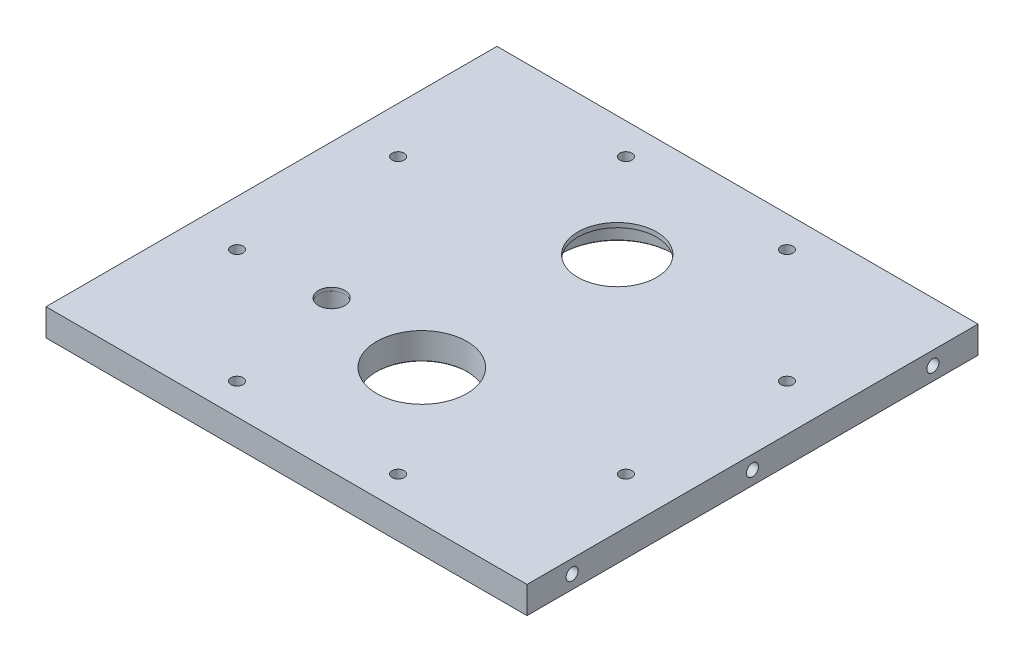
ISO-10303-21;
HEADER;
FILE_DESCRIPTION(('STEP AP214'),'2;1');
FILE_NAME('part.step','',(''),(''),'','','');
FILE_SCHEMA(('AUTOMOTIVE_DESIGN { 1 0 10303 214 1 1 1 1 }'));
ENDSEC;
DATA;
#1=APPLICATION_CONTEXT('core data for automotive mechanical design processes');
#2=APPLICATION_PROTOCOL_DEFINITION('international standard','automotive_design',2000,#1);
#3=PRODUCT_CONTEXT('',#1,'mechanical');
#4=PRODUCT('Part','Part','',(#3));
#5=PRODUCT_RELATED_PRODUCT_CATEGORY('part','',(#4));
#6=PRODUCT_DEFINITION_FORMATION('','',#4);
#7=PRODUCT_DEFINITION_CONTEXT('part definition',#1,'design');
#8=PRODUCT_DEFINITION('design','',#6,#7);
#9=PRODUCT_DEFINITION_SHAPE('','',#8);
#10=(LENGTH_UNIT() NAMED_UNIT(*) SI_UNIT(.MILLI.,.METRE.));
#11=(NAMED_UNIT(*) PLANE_ANGLE_UNIT() SI_UNIT($,.RADIAN.));
#12=(NAMED_UNIT(*) SI_UNIT($,.STERADIAN.) SOLID_ANGLE_UNIT());
#13=UNCERTAINTY_MEASURE_WITH_UNIT(LENGTH_MEASURE(1.E-05),#10,'distance_accuracy_value','');
#14=(GEOMETRIC_REPRESENTATION_CONTEXT(3) GLOBAL_UNCERTAINTY_ASSIGNED_CONTEXT((#13)) GLOBAL_UNIT_ASSIGNED_CONTEXT((#10,
#11,#12)) REPRESENTATION_CONTEXT('',''));
#15=CARTESIAN_POINT('',(0.,0.,0.));
#16=DIRECTION('',(0.,0.,1.));
#17=DIRECTION('',(1.,0.,0.));
#18=AXIS2_PLACEMENT_3D('',#15,#16,#17);
#19=CARTESIAN_POINT('',(0.,11.43,-44.45));
#20=DIRECTION('',(0.,-1.,0.));
#21=DIRECTION('',(0.,0.,-1.));
#22=AXIS2_PLACEMENT_3D('',#19,#20,#21);
#23=CYLINDRICAL_SURFACE('',#22,16.637);
#24=CARTESIAN_POINT('',(0.,11.43,-44.45));
#25=DIRECTION('',(0.,-1.,0.));
#26=DIRECTION('',(0.,0.,-1.));
#27=AXIS2_PLACEMENT_3D('',#24,#25,#26);
#28=CIRCLE('',#27,16.637);
#29=CARTESIAN_POINT('',(0.,11.43,-61.087));
#30=VERTEX_POINT('',#29);
#31=EDGE_CURVE('E320',#30,#30,#28,.T.);
#32=ORIENTED_EDGE('',*,*,#31,.F.);
#33=EDGE_LOOP('',(#32));
#34=FACE_BOUND('',#33,.T.);
#35=CARTESIAN_POINT('',(0.,9.525,-44.45));
#36=DIRECTION('',(0.,-1.,0.));
#37=DIRECTION('',(0.,0.,-1.));
#38=AXIS2_PLACEMENT_3D('',#35,#36,#37);
#39=CIRCLE('',#38,16.637);
#40=CARTESIAN_POINT('',(0.,9.525,-61.087));
#41=VERTEX_POINT('',#40);
#42=EDGE_CURVE('E319',#41,#41,#39,.F.);
#43=ORIENTED_EDGE('',*,*,#42,.F.);
#44=EDGE_LOOP('',(#43));
#45=FACE_BOUND('',#44,.T.);
#46=ADVANCED_FACE('F111',(#34,#45),#23,.F.);
#47=CARTESIAN_POINT('',(0.,11.43,0.));
#48=DIRECTION('',(0.,-1.,0.));
#49=DIRECTION('',(0.,0.,-1.));
#50=AXIS2_PLACEMENT_3D('',#47,#48,#49);
#51=PLANE('',#50);
#52=CARTESIAN_POINT('',(-44.45,11.43,31.75));
#53=DIRECTION('',(0.,-1.,0.));
#54=DIRECTION('',(0.,0.,-1.));
#55=AXIS2_PLACEMENT_3D('',#52,#53,#54);
#56=CIRCLE('',#55,5.5626);
#57=CARTESIAN_POINT('',(-44.45,11.43,26.1874));
#58=VERTEX_POINT('',#57);
#59=EDGE_CURVE('E311',#58,#58,#56,.T.);
#60=ORIENTED_EDGE('',*,*,#59,.T.);
#61=EDGE_LOOP('',(#60));
#62=FACE_BOUND('',#61,.T.);
#63=ORIENTED_EDGE('',*,*,#31,.T.);
#64=EDGE_LOOP('',(#63));
#65=FACE_BOUND('',#64,.T.);
#66=CARTESIAN_POINT('',(0.,11.43,38.1));
#67=DIRECTION('',(0.,-1.,0.));
#68=DIRECTION('',(0.,0.,-1.));
#69=AXIS2_PLACEMENT_3D('',#66,#67,#68);
#70=CIRCLE('',#69,19.0754);
#71=CARTESIAN_POINT('',(0.,11.43,19.0246));
#72=VERTEX_POINT('',#71);
#73=EDGE_CURVE('E324',#72,#72,#70,.T.);
#74=ORIENTED_EDGE('',*,*,#73,.T.);
#75=EDGE_LOOP('',(#74));
#76=FACE_BOUND('',#75,.T.);
#77=CARTESIAN_POINT('',(-82.132890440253,11.43,-34.0205571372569));
#78=DIRECTION('',(0.,1.,0.));
#79=DIRECTION('',(0.,0.,1.));
#80=AXIS2_PLACEMENT_3D('',#77,#78,#79);
#81=CIRCLE('',#80,2.55270000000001);
#82=CARTESIAN_POINT('',(-82.132890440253,11.43,-31.4678571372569));
#83=VERTEX_POINT('',#82);
#84=EDGE_CURVE('E328',#83,#83,#81,.T.);
#85=ORIENTED_EDGE('',*,*,#84,.F.);
#86=EDGE_LOOP('',(#85));
#87=FACE_BOUND('',#86,.T.);
#88=CARTESIAN_POINT('',(-34.0205571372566,11.43,82.1328904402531));
#89=DIRECTION('',(0.,1.,0.));
#90=DIRECTION('',(0.,0.,1.));
#91=AXIS2_PLACEMENT_3D('',#88,#89,#90);
#92=CIRCLE('',#91,2.5527);
#93=CARTESIAN_POINT('',(-34.0205571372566,11.43,84.6855904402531));
#94=VERTEX_POINT('',#93);
#95=EDGE_CURVE('E344',#94,#94,#92,.T.);
#96=ORIENTED_EDGE('',*,*,#95,.F.);
#97=EDGE_LOOP('',(#96));
#98=FACE_BOUND('',#97,.T.);
#99=CARTESIAN_POINT('',(34.0205571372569,11.43,82.132890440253));
#100=DIRECTION('',(0.,1.,0.));
#101=DIRECTION('',(0.,0.,1.));
#102=AXIS2_PLACEMENT_3D('',#99,#100,#101);
#103=CIRCLE('',#102,2.5527);
#104=CARTESIAN_POINT('',(34.0205571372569,11.43,84.685590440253));
#105=VERTEX_POINT('',#104);
#106=EDGE_CURVE('E352',#105,#105,#103,.T.);
#107=ORIENTED_EDGE('',*,*,#106,.F.);
#108=EDGE_LOOP('',(#107));
#109=FACE_BOUND('',#108,.T.);
#110=CARTESIAN_POINT('',(82.1328904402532,11.43,34.0205571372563));
#111=DIRECTION('',(0.,1.,0.));
#112=DIRECTION('',(0.,0.,1.));
#113=AXIS2_PLACEMENT_3D('',#110,#111,#112);
#114=CIRCLE('',#113,2.55270000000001);
#115=CARTESIAN_POINT('',(82.1328904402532,11.43,36.5732571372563));
#116=VERTEX_POINT('',#115);
#117=EDGE_CURVE('E360',#116,#116,#114,.T.);
#118=ORIENTED_EDGE('',*,*,#117,.F.);
#119=EDGE_LOOP('',(#118));
#120=FACE_BOUND('',#119,.T.);
#121=CARTESIAN_POINT('',(82.1328904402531,11.43,-34.0205571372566));
#122=DIRECTION('',(0.,1.,0.));
#123=DIRECTION('',(0.,0.,1.));
#124=AXIS2_PLACEMENT_3D('',#121,#122,#123);
#125=CIRCLE('',#124,2.55270000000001);
#126=CARTESIAN_POINT('',(82.1328904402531,11.43,-31.4678571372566));
#127=VERTEX_POINT('',#126);
#128=EDGE_CURVE('E368',#127,#127,#125,.T.);
#129=ORIENTED_EDGE('',*,*,#128,.F.);
#130=EDGE_LOOP('',(#129));
#131=FACE_BOUND('',#130,.T.);
#132=CARTESIAN_POINT('',(34.020557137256,11.43,-82.1328904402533));
#133=DIRECTION('',(0.,1.,0.));
#134=DIRECTION('',(0.,0.,1.));
#135=AXIS2_PLACEMENT_3D('',#132,#133,#134);
#136=CIRCLE('',#135,2.5527);
#137=CARTESIAN_POINT('',(34.020557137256,11.43,-79.5801904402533));
#138=VERTEX_POINT('',#137);
#139=EDGE_CURVE('E376',#138,#138,#136,.T.);
#140=ORIENTED_EDGE('',*,*,#139,.F.);
#141=EDGE_LOOP('',(#140));
#142=FACE_BOUND('',#141,.T.);
#143=CARTESIAN_POINT('',(-34.0205571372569,11.43,-82.132890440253));
#144=DIRECTION('',(0.,1.,0.));
#145=DIRECTION('',(0.,0.,1.));
#146=AXIS2_PLACEMENT_3D('',#143,#144,#145);
#147=CIRCLE('',#146,2.5527);
#148=CARTESIAN_POINT('',(-34.0205571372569,11.43,-79.5801904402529));
#149=VERTEX_POINT('',#148);
#150=EDGE_CURVE('E384',#149,#149,#147,.T.);
#151=ORIENTED_EDGE('',*,*,#150,.F.);
#152=EDGE_LOOP('',(#151));
#153=FACE_BOUND('',#152,.T.);
#154=DIRECTION('',(0.,0.,-1.));
#155=VECTOR('',#154,1.);
#156=CARTESIAN_POINT('',(101.6,11.43,95.25));
#157=LINE('',#156,#155);
#158=CARTESIAN_POINT('',(101.6,11.43,95.25));
#159=VERTEX_POINT('',#158);
#160=CARTESIAN_POINT('',(101.6,11.43,-95.25));
#161=VERTEX_POINT('',#160);
#162=EDGE_CURVE('E393',#159,#161,#157,.T.);
#163=ORIENTED_EDGE('',*,*,#162,.T.);
#164=DIRECTION('',(-1.,0.,0.));
#165=VECTOR('',#164,1.);
#166=CARTESIAN_POINT('',(-101.6,11.43,-95.25));
#167=LINE('',#166,#165);
#168=CARTESIAN_POINT('',(-101.6,11.43,-95.25));
#169=VERTEX_POINT('',#168);
#170=EDGE_CURVE('E162',#161,#169,#167,.T.);
#171=ORIENTED_EDGE('',*,*,#170,.T.);
#172=DIRECTION('',(0.,0.,1.));
#173=VECTOR('',#172,1.);
#174=CARTESIAN_POINT('',(-101.6,11.43,95.25));
#175=LINE('',#174,#173);
#176=CARTESIAN_POINT('',(-101.6,11.43,95.25));
#177=VERTEX_POINT('',#176);
#178=EDGE_CURVE('E398',#169,#177,#175,.T.);
#179=ORIENTED_EDGE('',*,*,#178,.T.);
#180=DIRECTION('',(1.,0.,0.));
#181=VECTOR('',#180,1.);
#182=CARTESIAN_POINT('',(-101.6,11.43,95.25));
#183=LINE('',#182,#181);
#184=EDGE_CURVE('E130',#177,#159,#183,.T.);
#185=ORIENTED_EDGE('',*,*,#184,.T.);
#186=EDGE_LOOP('',(#163,#171,#179,#185));
#187=FACE_BOUND('',#186,.T.);
#188=CARTESIAN_POINT('',(-82.1328904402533,11.43,34.020557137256));
#189=DIRECTION('',(0.,1.,0.));
#190=DIRECTION('',(0.,0.,1.));
#191=AXIS2_PLACEMENT_3D('',#188,#189,#190);
#192=CIRCLE('',#191,2.55270000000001);
#193=CARTESIAN_POINT('',(-82.1328904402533,11.43,36.573257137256));
#194=VERTEX_POINT('',#193);
#195=EDGE_CURVE('E336',#194,#194,#192,.T.);
#196=ORIENTED_EDGE('',*,*,#195,.F.);
#197=EDGE_LOOP('',(#196));
#198=FACE_BOUND('',#197,.T.);
#199=ADVANCED_FACE('F463',(#62,#65,#76,#87,#98,#109,#120,#131,#142,#153,#187,#198),#51,.F.);
#200=CARTESIAN_POINT('',(101.6,11.43,95.25));
#201=DIRECTION('',(-1.,0.,0.));
#202=DIRECTION('',(0.,0.,1.));
#203=AXIS2_PLACEMENT_3D('',#200,#201,#202);
#204=PLANE('',#203);
#205=CARTESIAN_POINT('',(101.6,5.715,-76.2));
#206=DIRECTION('',(1.,0.,0.));
#207=DIRECTION('',(0.,0.,-1.));
#208=AXIS2_PLACEMENT_3D('',#205,#206,#207);
#209=CIRCLE('',#208,2.55269999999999);
#210=CARTESIAN_POINT('',(101.6,5.715,-78.7527));
#211=VERTEX_POINT('',#210);
#212=EDGE_CURVE('E205',#211,#211,#209,.T.);
#213=ORIENTED_EDGE('',*,*,#212,.F.);
#214=EDGE_LOOP('',(#213));
#215=FACE_BOUND('',#214,.T.);
#216=CARTESIAN_POINT('',(101.6,5.715,76.2));
#217=DIRECTION('',(1.,0.,0.));
#218=DIRECTION('',(0.,0.,-1.));
#219=AXIS2_PLACEMENT_3D('',#216,#217,#218);
#220=CIRCLE('',#219,2.55269999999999);
#221=CARTESIAN_POINT('',(101.6,5.715,73.6473));
#222=VERTEX_POINT('',#221);
#223=EDGE_CURVE('E204',#222,#222,#220,.T.);
#224=ORIENTED_EDGE('',*,*,#223,.F.);
#225=EDGE_LOOP('',(#224));
#226=FACE_BOUND('',#225,.T.);
#227=CARTESIAN_POINT('',(101.6,5.715,0.));
#228=DIRECTION('',(1.,0.,0.));
#229=DIRECTION('',(0.,0.,-1.));
#230=AXIS2_PLACEMENT_3D('',#227,#228,#229);
#231=CIRCLE('',#230,2.55269999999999);
#232=CARTESIAN_POINT('',(101.6,5.715,-2.55269999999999));
#233=VERTEX_POINT('',#232);
#234=EDGE_CURVE('E219',#233,#233,#231,.T.);
#235=ORIENTED_EDGE('',*,*,#234,.F.);
#236=EDGE_LOOP('',(#235));
#237=FACE_BOUND('',#236,.T.);
#238=DIRECTION('',(0.,0.,-1.));
#239=VECTOR('',#238,1.);
#240=CARTESIAN_POINT('',(101.6,0.,95.25));
#241=LINE('',#240,#239);
#242=CARTESIAN_POINT('',(101.6,0.,95.25));
#243=VERTEX_POINT('',#242);
#244=CARTESIAN_POINT('',(101.6,0.,-95.25));
#245=VERTEX_POINT('',#244);
#246=EDGE_CURVE('E392',#243,#245,#241,.T.);
#247=ORIENTED_EDGE('',*,*,#246,.T.);
#248=DIRECTION('',(0.,-1.,0.));
#249=VECTOR('',#248,1.);
#250=CARTESIAN_POINT('',(101.6,11.43,-95.25));
#251=LINE('',#250,#249);
#252=EDGE_CURVE('E422',#161,#245,#251,.T.);
#253=ORIENTED_EDGE('',*,*,#252,.F.);
#254=ORIENTED_EDGE('',*,*,#162,.F.);
#255=DIRECTION('',(0.,-1.,0.));
#256=VECTOR('',#255,1.);
#257=CARTESIAN_POINT('',(101.6,11.43,95.25));
#258=LINE('',#257,#256);
#259=EDGE_CURVE('E403',#159,#243,#258,.T.);
#260=ORIENTED_EDGE('',*,*,#259,.T.);
#261=EDGE_LOOP('',(#247,#253,#254,#260));
#262=FACE_BOUND('',#261,.T.);
#263=ADVANCED_FACE('F470',(#215,#226,#237,#262),#204,.F.);
#264=CARTESIAN_POINT('',(-101.6,11.43,-95.25));
#265=DIRECTION('',(0.,0.,1.));
#266=DIRECTION('',(1.,0.,0.));
#267=AXIS2_PLACEMENT_3D('',#264,#265,#266);
#268=PLANE('',#267);
#269=DIRECTION('',(-1.,0.,0.));
#270=VECTOR('',#269,1.);
#271=CARTESIAN_POINT('',(-101.6,0.,-95.25));
#272=LINE('',#271,#270);
#273=CARTESIAN_POINT('',(-101.6,0.,-95.25));
#274=VERTEX_POINT('',#273);
#275=EDGE_CURVE('E407',#245,#274,#272,.T.);
#276=ORIENTED_EDGE('',*,*,#275,.T.);
#277=DIRECTION('',(0.,-1.,0.));
#278=VECTOR('',#277,1.);
#279=CARTESIAN_POINT('',(-101.6,11.43,-95.25));
#280=LINE('',#279,#278);
#281=EDGE_CURVE('E419',#169,#274,#280,.T.);
#282=ORIENTED_EDGE('',*,*,#281,.F.);
#283=ORIENTED_EDGE('',*,*,#170,.F.);
#284=ORIENTED_EDGE('',*,*,#252,.T.);
#285=EDGE_LOOP('',(#276,#282,#283,#284));
#286=FACE_BOUND('',#285,.T.);
#287=ADVANCED_FACE('F518',(#286),#268,.F.);
#288=CARTESIAN_POINT('',(-101.6,11.43,95.25));
#289=DIRECTION('',(1.,0.,0.));
#290=DIRECTION('',(0.,0.,-1.));
#291=AXIS2_PLACEMENT_3D('',#288,#289,#290);
#292=PLANE('',#291);
#293=CARTESIAN_POINT('',(-101.6,5.715,-76.2));
#294=DIRECTION('',(-1.,0.,0.));
#295=DIRECTION('',(0.,0.,1.));
#296=AXIS2_PLACEMENT_3D('',#293,#294,#295);
#297=CIRCLE('',#296,2.55269999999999);
#298=CARTESIAN_POINT('',(-101.6,5.715,-73.6473));
#299=VERTEX_POINT('',#298);
#300=EDGE_CURVE('E227',#299,#299,#297,.T.);
#301=ORIENTED_EDGE('',*,*,#300,.F.);
#302=EDGE_LOOP('',(#301));
#303=FACE_BOUND('',#302,.T.);
#304=CARTESIAN_POINT('',(-101.6,5.715,76.2));
#305=DIRECTION('',(-1.,0.,0.));
#306=DIRECTION('',(0.,0.,1.));
#307=AXIS2_PLACEMENT_3D('',#304,#305,#306);
#308=CIRCLE('',#307,2.55269999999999);
#309=CARTESIAN_POINT('',(-101.6,5.715,78.7527));
#310=VERTEX_POINT('',#309);
#311=EDGE_CURVE('E235',#310,#310,#308,.T.);
#312=ORIENTED_EDGE('',*,*,#311,.F.);
#313=EDGE_LOOP('',(#312));
#314=FACE_BOUND('',#313,.T.);
#315=CARTESIAN_POINT('',(-101.6,5.715,0.));
#316=DIRECTION('',(-1.,0.,0.));
#317=DIRECTION('',(0.,0.,1.));
#318=AXIS2_PLACEMENT_3D('',#315,#316,#317);
#319=CIRCLE('',#318,2.55269999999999);
#320=CARTESIAN_POINT('',(-101.6,5.715,2.55269999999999));
#321=VERTEX_POINT('',#320);
#322=EDGE_CURVE('E243',#321,#321,#319,.T.);
#323=ORIENTED_EDGE('',*,*,#322,.F.);
#324=EDGE_LOOP('',(#323));
#325=FACE_BOUND('',#324,.T.);
#326=DIRECTION('',(0.,0.,1.));
#327=VECTOR('',#326,1.);
#328=CARTESIAN_POINT('',(-101.6,0.,95.25));
#329=LINE('',#328,#327);
#330=CARTESIAN_POINT('',(-101.6,0.,95.25));
#331=VERTEX_POINT('',#330);
#332=EDGE_CURVE('E148',#274,#331,#329,.T.);
#333=ORIENTED_EDGE('',*,*,#332,.T.);
#334=DIRECTION('',(0.,-1.,0.));
#335=VECTOR('',#334,1.);
#336=CARTESIAN_POINT('',(-101.6,11.43,95.25));
#337=LINE('',#336,#335);
#338=EDGE_CURVE('E416',#177,#331,#337,.T.);
#339=ORIENTED_EDGE('',*,*,#338,.F.);
#340=ORIENTED_EDGE('',*,*,#178,.F.);
#341=ORIENTED_EDGE('',*,*,#281,.T.);
#342=EDGE_LOOP('',(#333,#339,#340,#341));
#343=FACE_BOUND('',#342,.T.);
#344=ADVANCED_FACE('F515',(#303,#314,#325,#343),#292,.F.);
#345=CARTESIAN_POINT('',(-101.6,11.43,95.25));
#346=DIRECTION('',(0.,0.,-1.));
#347=DIRECTION('',(-1.,0.,0.));
#348=AXIS2_PLACEMENT_3D('',#345,#346,#347);
#349=PLANE('',#348);
#350=DIRECTION('',(1.,0.,0.));
#351=VECTOR('',#350,1.);
#352=CARTESIAN_POINT('',(-101.6,0.,95.25));
#353=LINE('',#352,#351);
#354=EDGE_CURVE('E154',#331,#243,#353,.T.);
#355=ORIENTED_EDGE('',*,*,#354,.T.);
#356=ORIENTED_EDGE('',*,*,#259,.F.);
#357=ORIENTED_EDGE('',*,*,#184,.F.);
#358=ORIENTED_EDGE('',*,*,#338,.T.);
#359=EDGE_LOOP('',(#355,#356,#357,#358));
#360=FACE_BOUND('',#359,.T.);
#361=ADVANCED_FACE('F512',(#360),#349,.F.);
#362=CARTESIAN_POINT('',(0.,0.,0.));
#363=DIRECTION('',(0.,-1.,0.));
#364=DIRECTION('',(0.,0.,-1.));
#365=AXIS2_PLACEMENT_3D('',#362,#363,#364);
#366=PLANE('',#365);
#367=CARTESIAN_POINT('',(0.,0.,-44.45));
#368=DIRECTION('',(0.,-1.,0.));
#369=DIRECTION('',(0.,0.,-1.));
#370=AXIS2_PLACEMENT_3D('',#367,#368,#369);
#371=CIRCLE('',#370,23.56866);
#372=CARTESIAN_POINT('',(0.,0.,-68.01866));
#373=VERTEX_POINT('',#372);
#374=EDGE_CURVE('E122',#373,#373,#371,.F.);
#375=ORIENTED_EDGE('',*,*,#374,.T.);
#376=EDGE_LOOP('',(#375));
#377=FACE_BOUND('',#376,.T.);
#378=CARTESIAN_POINT('',(0.,0.,38.1));
#379=DIRECTION('',(0.,-1.,0.));
#380=DIRECTION('',(0.,0.,-1.));
#381=AXIS2_PLACEMENT_3D('',#378,#379,#380);
#382=CIRCLE('',#381,19.4665599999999);
#383=CARTESIAN_POINT('',(0.,0.,18.6334400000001));
#384=VERTEX_POINT('',#383);
#385=EDGE_CURVE('E432',#384,#384,#382,.F.);
#386=ORIENTED_EDGE('',*,*,#385,.T.);
#387=EDGE_LOOP('',(#386));
#388=FACE_BOUND('',#387,.T.);
#389=CARTESIAN_POINT('',(-22.225,0.,38.1000000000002));
#390=DIRECTION('',(0.,-1.,0.));
#391=DIRECTION('',(0.,0.,-1.));
#392=AXIS2_PLACEMENT_3D('',#389,#390,#391);
#393=CIRCLE('',#392,1.9939);
#394=CARTESIAN_POINT('',(-22.225,0.,36.1061000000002));
#395=VERTEX_POINT('',#394);
#396=EDGE_CURVE('E251',#395,#395,#393,.T.);
#397=ORIENTED_EDGE('',*,*,#396,.F.);
#398=EDGE_LOOP('',(#397));
#399=FACE_BOUND('',#398,.T.);
#400=CARTESIAN_POINT('',(0.,0.,15.875));
#401=DIRECTION('',(0.,-1.,0.));
#402=DIRECTION('',(0.,0.,-1.));
#403=AXIS2_PLACEMENT_3D('',#400,#401,#402);
#404=CIRCLE('',#403,1.9939);
#405=CARTESIAN_POINT('',(0.,0.,13.8811));
#406=VERTEX_POINT('',#405);
#407=EDGE_CURVE('E263',#406,#406,#404,.T.);
#408=ORIENTED_EDGE('',*,*,#407,.F.);
#409=EDGE_LOOP('',(#408));
#410=FACE_BOUND('',#409,.T.);
#411=CARTESIAN_POINT('',(22.225,0.,38.0999999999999));
#412=DIRECTION('',(0.,-1.,0.));
#413=DIRECTION('',(0.,0.,-1.));
#414=AXIS2_PLACEMENT_3D('',#411,#412,#413);
#415=CIRCLE('',#414,1.9939);
#416=CARTESIAN_POINT('',(22.225,0.,36.1060999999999));
#417=VERTEX_POINT('',#416);
#418=EDGE_CURVE('E275',#417,#417,#415,.T.);
#419=ORIENTED_EDGE('',*,*,#418,.F.);
#420=EDGE_LOOP('',(#419));
#421=FACE_BOUND('',#420,.T.);
#422=CARTESIAN_POINT('',(0.,0.,60.325));
#423=DIRECTION('',(0.,-1.,0.));
#424=DIRECTION('',(0.,0.,-1.));
#425=AXIS2_PLACEMENT_3D('',#422,#423,#424);
#426=CIRCLE('',#425,1.9939);
#427=CARTESIAN_POINT('',(0.,0.,58.3311));
#428=VERTEX_POINT('',#427);
#429=EDGE_CURVE('E287',#428,#428,#426,.T.);
#430=ORIENTED_EDGE('',*,*,#429,.F.);
#431=EDGE_LOOP('',(#430));
#432=FACE_BOUND('',#431,.T.);
#433=CARTESIAN_POINT('',(-44.45,0.,31.75));
#434=DIRECTION('',(0.,-1.,0.));
#435=DIRECTION('',(0.,0.,-1.));
#436=AXIS2_PLACEMENT_3D('',#433,#434,#435);
#437=CIRCLE('',#436,6.244082);
#438=CARTESIAN_POINT('',(-44.45,0.,25.505918));
#439=VERTEX_POINT('',#438);
#440=EDGE_CURVE('E299',#439,#439,#437,.T.);
#441=ORIENTED_EDGE('',*,*,#440,.F.);
#442=EDGE_LOOP('',(#441));
#443=FACE_BOUND('',#442,.T.);
#444=CARTESIAN_POINT('',(-82.132890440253,0.,-34.0205571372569));
#445=DIRECTION('',(0.,1.,0.));
#446=DIRECTION('',(0.,0.,1.));
#447=AXIS2_PLACEMENT_3D('',#444,#445,#446);
#448=CIRCLE('',#447,2.55269999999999);
#449=CARTESIAN_POINT('',(-82.132890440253,0.,-31.4678571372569));
#450=VERTEX_POINT('',#449);
#451=EDGE_CURVE('E332',#450,#450,#448,.T.);
#452=ORIENTED_EDGE('',*,*,#451,.T.);
#453=EDGE_LOOP('',(#452));
#454=FACE_BOUND('',#453,.T.);
#455=CARTESIAN_POINT('',(-82.1328904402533,0.,34.020557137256));
#456=DIRECTION('',(0.,1.,0.));
#457=DIRECTION('',(0.,0.,1.));
#458=AXIS2_PLACEMENT_3D('',#455,#456,#457);
#459=CIRCLE('',#458,2.55269999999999);
#460=CARTESIAN_POINT('',(-82.1328904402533,0.,36.573257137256));
#461=VERTEX_POINT('',#460);
#462=EDGE_CURVE('E340',#461,#461,#459,.T.);
#463=ORIENTED_EDGE('',*,*,#462,.T.);
#464=EDGE_LOOP('',(#463));
#465=FACE_BOUND('',#464,.T.);
#466=CARTESIAN_POINT('',(-34.0205571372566,0.,82.1328904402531));
#467=DIRECTION('',(0.,1.,0.));
#468=DIRECTION('',(0.,0.,1.));
#469=AXIS2_PLACEMENT_3D('',#466,#467,#468);
#470=CIRCLE('',#469,2.5527);
#471=CARTESIAN_POINT('',(-34.0205571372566,0.,84.6855904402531));
#472=VERTEX_POINT('',#471);
#473=EDGE_CURVE('E348',#472,#472,#470,.T.);
#474=ORIENTED_EDGE('',*,*,#473,.T.);
#475=EDGE_LOOP('',(#474));
#476=FACE_BOUND('',#475,.T.);
#477=CARTESIAN_POINT('',(34.0205571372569,0.,82.132890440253));
#478=DIRECTION('',(0.,1.,0.));
#479=DIRECTION('',(0.,0.,1.));
#480=AXIS2_PLACEMENT_3D('',#477,#478,#479);
#481=CIRCLE('',#480,2.5527);
#482=CARTESIAN_POINT('',(34.0205571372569,0.,84.685590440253));
#483=VERTEX_POINT('',#482);
#484=EDGE_CURVE('E356',#483,#483,#481,.T.);
#485=ORIENTED_EDGE('',*,*,#484,.T.);
#486=EDGE_LOOP('',(#485));
#487=FACE_BOUND('',#486,.T.);
#488=CARTESIAN_POINT('',(82.1328904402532,0.,34.0205571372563));
#489=DIRECTION('',(0.,1.,0.));
#490=DIRECTION('',(0.,0.,1.));
#491=AXIS2_PLACEMENT_3D('',#488,#489,#490);
#492=CIRCLE('',#491,2.55269999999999);
#493=CARTESIAN_POINT('',(82.1328904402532,0.,36.5732571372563));
#494=VERTEX_POINT('',#493);
#495=EDGE_CURVE('E364',#494,#494,#492,.T.);
#496=ORIENTED_EDGE('',*,*,#495,.T.);
#497=EDGE_LOOP('',(#496));
#498=FACE_BOUND('',#497,.T.);
#499=CARTESIAN_POINT('',(82.1328904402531,0.,-34.0205571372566));
#500=DIRECTION('',(0.,1.,0.));
#501=DIRECTION('',(0.,0.,1.));
#502=AXIS2_PLACEMENT_3D('',#499,#500,#501);
#503=CIRCLE('',#502,2.55269999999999);
#504=CARTESIAN_POINT('',(82.1328904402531,0.,-31.4678571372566));
#505=VERTEX_POINT('',#504);
#506=EDGE_CURVE('E372',#505,#505,#503,.T.);
#507=ORIENTED_EDGE('',*,*,#506,.T.);
#508=EDGE_LOOP('',(#507));
#509=FACE_BOUND('',#508,.T.);
#510=CARTESIAN_POINT('',(34.020557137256,0.,-82.1328904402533));
#511=DIRECTION('',(0.,1.,0.));
#512=DIRECTION('',(0.,0.,1.));
#513=AXIS2_PLACEMENT_3D('',#510,#511,#512);
#514=CIRCLE('',#513,2.5527);
#515=CARTESIAN_POINT('',(34.020557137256,0.,-79.5801904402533));
#516=VERTEX_POINT('',#515);
#517=EDGE_CURVE('E380',#516,#516,#514,.T.);
#518=ORIENTED_EDGE('',*,*,#517,.T.);
#519=EDGE_LOOP('',(#518));
#520=FACE_BOUND('',#519,.T.);
#521=CARTESIAN_POINT('',(-34.0205571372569,0.,-82.132890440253));
#522=DIRECTION('',(0.,1.,0.));
#523=DIRECTION('',(0.,0.,1.));
#524=AXIS2_PLACEMENT_3D('',#521,#522,#523);
#525=CIRCLE('',#524,2.5527);
#526=CARTESIAN_POINT('',(-34.0205571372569,0.,-79.5801904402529));
#527=VERTEX_POINT('',#526);
#528=EDGE_CURVE('E388',#527,#527,#525,.T.);
#529=ORIENTED_EDGE('',*,*,#528,.T.);
#530=EDGE_LOOP('',(#529));
#531=FACE_BOUND('',#530,.T.);
#532=ORIENTED_EDGE('',*,*,#246,.F.);
#533=ORIENTED_EDGE('',*,*,#354,.F.);
#534=ORIENTED_EDGE('',*,*,#332,.F.);
#535=ORIENTED_EDGE('',*,*,#275,.F.);
#536=EDGE_LOOP('',(#532,#533,#534,#535));
#537=FACE_BOUND('',#536,.T.);
#538=ADVANCED_FACE('F440',(#377,#388,#399,#410,#421,#432,#443,#454,#465,#476,#487,#498,#509,
#520,#531,#537),#366,.T.);
#539=CARTESIAN_POINT('',(-34.0205571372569,11.43,-82.132890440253));
#540=DIRECTION('',(0.,1.,0.));
#541=DIRECTION('',(0.,0.,1.));
#542=AXIS2_PLACEMENT_3D('',#539,#540,#541);
#543=CYLINDRICAL_SURFACE('',#542,2.5527);
#544=ORIENTED_EDGE('',*,*,#528,.F.);
#545=EDGE_LOOP('',(#544));
#546=FACE_BOUND('',#545,.T.);
#547=ORIENTED_EDGE('',*,*,#150,.T.);
#548=EDGE_LOOP('',(#547));
#549=FACE_BOUND('',#548,.T.);
#550=ADVANCED_FACE('F505',(#546,#549),#543,.F.);
#551=CARTESIAN_POINT('',(34.020557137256,11.43,-82.1328904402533));
#552=DIRECTION('',(0.,1.,0.));
#553=DIRECTION('',(0.,0.,1.));
#554=AXIS2_PLACEMENT_3D('',#551,#552,#553);
#555=CYLINDRICAL_SURFACE('',#554,2.5527);
#556=ORIENTED_EDGE('',*,*,#517,.F.);
#557=EDGE_LOOP('',(#556));
#558=FACE_BOUND('',#557,.T.);
#559=ORIENTED_EDGE('',*,*,#139,.T.);
#560=EDGE_LOOP('',(#559));
#561=FACE_BOUND('',#560,.T.);
#562=ADVANCED_FACE('F501',(#558,#561),#555,.F.);
#563=CARTESIAN_POINT('',(82.1328904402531,11.43,-34.0205571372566));
#564=DIRECTION('',(0.,1.,0.));
#565=DIRECTION('',(0.,0.,1.));
#566=AXIS2_PLACEMENT_3D('',#563,#564,#565);
#567=CYLINDRICAL_SURFACE('',#566,2.5527);
#568=ORIENTED_EDGE('',*,*,#506,.F.);
#569=EDGE_LOOP('',(#568));
#570=FACE_BOUND('',#569,.T.);
#571=ORIENTED_EDGE('',*,*,#128,.T.);
#572=EDGE_LOOP('',(#571));
#573=FACE_BOUND('',#572,.T.);
#574=ADVANCED_FACE('F497',(#570,#573),#567,.F.);
#575=CARTESIAN_POINT('',(82.1328904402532,11.43,34.0205571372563));
#576=DIRECTION('',(0.,1.,0.));
#577=DIRECTION('',(0.,0.,1.));
#578=AXIS2_PLACEMENT_3D('',#575,#576,#577);
#579=CYLINDRICAL_SURFACE('',#578,2.5527);
#580=ORIENTED_EDGE('',*,*,#495,.F.);
#581=EDGE_LOOP('',(#580));
#582=FACE_BOUND('',#581,.T.);
#583=ORIENTED_EDGE('',*,*,#117,.T.);
#584=EDGE_LOOP('',(#583));
#585=FACE_BOUND('',#584,.T.);
#586=ADVANCED_FACE('F493',(#582,#585),#579,.F.);
#587=CARTESIAN_POINT('',(34.0205571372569,11.43,82.132890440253));
#588=DIRECTION('',(0.,1.,0.));
#589=DIRECTION('',(0.,0.,1.));
#590=AXIS2_PLACEMENT_3D('',#587,#588,#589);
#591=CYLINDRICAL_SURFACE('',#590,2.5527);
#592=ORIENTED_EDGE('',*,*,#484,.F.);
#593=EDGE_LOOP('',(#592));
#594=FACE_BOUND('',#593,.T.);
#595=ORIENTED_EDGE('',*,*,#106,.T.);
#596=EDGE_LOOP('',(#595));
#597=FACE_BOUND('',#596,.T.);
#598=ADVANCED_FACE('F489',(#594,#597),#591,.F.);
#599=CARTESIAN_POINT('',(-34.0205571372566,11.43,82.1328904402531));
#600=DIRECTION('',(0.,1.,0.));
#601=DIRECTION('',(0.,0.,1.));
#602=AXIS2_PLACEMENT_3D('',#599,#600,#601);
#603=CYLINDRICAL_SURFACE('',#602,2.5527);
#604=ORIENTED_EDGE('',*,*,#473,.F.);
#605=EDGE_LOOP('',(#604));
#606=FACE_BOUND('',#605,.T.);
#607=ORIENTED_EDGE('',*,*,#95,.T.);
#608=EDGE_LOOP('',(#607));
#609=FACE_BOUND('',#608,.T.);
#610=ADVANCED_FACE('F485',(#606,#609),#603,.F.);
#611=CARTESIAN_POINT('',(-82.1328904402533,11.43,34.020557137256));
#612=DIRECTION('',(0.,1.,0.));
#613=DIRECTION('',(0.,0.,1.));
#614=AXIS2_PLACEMENT_3D('',#611,#612,#613);
#615=CYLINDRICAL_SURFACE('',#614,2.5527);
#616=ORIENTED_EDGE('',*,*,#462,.F.);
#617=EDGE_LOOP('',(#616));
#618=FACE_BOUND('',#617,.T.);
#619=ORIENTED_EDGE('',*,*,#195,.T.);
#620=EDGE_LOOP('',(#619));
#621=FACE_BOUND('',#620,.T.);
#622=ADVANCED_FACE('F481',(#618,#621),#615,.F.);
#623=CARTESIAN_POINT('',(-82.132890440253,11.43,-34.0205571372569));
#624=DIRECTION('',(0.,1.,0.));
#625=DIRECTION('',(0.,0.,1.));
#626=AXIS2_PLACEMENT_3D('',#623,#624,#625);
#627=CYLINDRICAL_SURFACE('',#626,2.5527);
#628=ORIENTED_EDGE('',*,*,#451,.F.);
#629=EDGE_LOOP('',(#628));
#630=FACE_BOUND('',#629,.T.);
#631=ORIENTED_EDGE('',*,*,#84,.T.);
#632=EDGE_LOOP('',(#631));
#633=FACE_BOUND('',#632,.T.);
#634=ADVANCED_FACE('F477',(#630,#633),#627,.F.);
#635=CARTESIAN_POINT('',(0.,11.43,38.1));
#636=DIRECTION('',(0.,-1.,0.));
#637=DIRECTION('',(0.,0.,-1.));
#638=AXIS2_PLACEMENT_3D('',#635,#636,#637);
#639=CYLINDRICAL_SURFACE('',#638,19.0754);
#640=CARTESIAN_POINT('',(0.,0.391159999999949,38.1));
#641=DIRECTION('',(0.,-1.,0.));
#642=DIRECTION('',(0.,0.,-1.));
#643=AXIS2_PLACEMENT_3D('',#640,#641,#642);
#644=CIRCLE('',#643,19.0754);
#645=CARTESIAN_POINT('',(0.,0.391159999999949,19.0246));
#646=VERTEX_POINT('',#645);
#647=EDGE_CURVE('E14',#646,#646,#644,.T.);
#648=ORIENTED_EDGE('',*,*,#647,.T.);
#649=EDGE_LOOP('',(#648));
#650=FACE_BOUND('',#649,.T.);
#651=ORIENTED_EDGE('',*,*,#73,.F.);
#652=EDGE_LOOP('',(#651));
#653=FACE_BOUND('',#652,.T.);
#654=ADVANCED_FACE('F458',(#650,#653),#639,.F.);
#655=CARTESIAN_POINT('',(0.,9.525,-44.45));
#656=DIRECTION('',(0.,-1.,0.));
#657=DIRECTION('',(0.,0.,-1.));
#658=AXIS2_PLACEMENT_3D('',#655,#656,#657);
#659=PLANE('',#658);
#660=CARTESIAN_POINT('',(0.,9.525,-44.45));
#661=DIRECTION('',(0.,-1.,0.));
#662=DIRECTION('',(0.,0.,-1.));
#663=AXIS2_PLACEMENT_3D('',#660,#661,#662);
#664=CIRCLE('',#663,23.1775);
#665=CARTESIAN_POINT('',(0.,9.525,-67.6275));
#666=VERTEX_POINT('',#665);
#667=EDGE_CURVE('E315',#666,#666,#664,.T.);
#668=ORIENTED_EDGE('',*,*,#667,.T.);
#669=EDGE_LOOP('',(#668));
#670=FACE_BOUND('',#669,.T.);
#671=ORIENTED_EDGE('',*,*,#42,.T.);
#672=EDGE_LOOP('',(#671));
#673=FACE_BOUND('',#672,.T.);
#674=ADVANCED_FACE('F452',(#670,#673),#659,.T.);
#675=CARTESIAN_POINT('',(0.,9.525,-44.45));
#676=DIRECTION('',(0.,-1.,0.));
#677=DIRECTION('',(0.,0.,-1.));
#678=AXIS2_PLACEMENT_3D('',#675,#676,#677);
#679=CYLINDRICAL_SURFACE('',#678,23.1775);
#680=CARTESIAN_POINT('',(0.,0.391160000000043,-44.45));
#681=DIRECTION('',(0.,-1.,0.));
#682=DIRECTION('',(0.,0.,-1.));
#683=AXIS2_PLACEMENT_3D('',#680,#681,#682);
#684=CIRCLE('',#683,23.1775);
#685=CARTESIAN_POINT('',(0.,0.391160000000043,-67.6275));
#686=VERTEX_POINT('',#685);
#687=EDGE_CURVE('E425',#686,#686,#684,.T.);
#688=CARTESIAN_POINT('',(0.,0.391160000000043,-67.6275));
#689=CARTESIAN_POINT('',(0.,0.486304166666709,-67.6275));
#690=CARTESIAN_POINT('',(0.,0.581448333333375,-67.6275));
#691=CARTESIAN_POINT('',(0.,0.771736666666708,-67.6275));
#692=CARTESIAN_POINT('',(0.,0.866880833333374,-67.6275));
#693=CARTESIAN_POINT('',(0.,1.05716916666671,-67.6275));
#694=CARTESIAN_POINT('',(0.,1.15231333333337,-67.6275));
#695=CARTESIAN_POINT('',(0.,1.34260166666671,-67.6275));
#696=CARTESIAN_POINT('',(0.,1.43774583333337,-67.6275));
#697=CARTESIAN_POINT('',(0.,1.6280341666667,-67.6275));
#698=CARTESIAN_POINT('',(0.,1.72317833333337,-67.6275));
#699=CARTESIAN_POINT('',(0.,1.9134666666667,-67.6275));
#700=CARTESIAN_POINT('',(0.,2.00861083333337,-67.6275));
#701=CARTESIAN_POINT('',(0.,2.1988991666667,-67.6275));
#702=CARTESIAN_POINT('',(0.,2.29404333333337,-67.6275));
#703=CARTESIAN_POINT('',(0.,2.4843316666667,-67.6275));
#704=CARTESIAN_POINT('',(0.,2.57947583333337,-67.6275));
#705=CARTESIAN_POINT('',(0.,2.7697641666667,-67.6275));
#706=CARTESIAN_POINT('',(0.,2.86490833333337,-67.6275));
#707=CARTESIAN_POINT('',(0.,3.0551966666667,-67.6275));
#708=CARTESIAN_POINT('',(0.,3.15034083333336,-67.6275));
#709=CARTESIAN_POINT('',(0.,3.3406291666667,-67.6275));
#710=CARTESIAN_POINT('',(0.,3.43577333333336,-67.6275));
#711=CARTESIAN_POINT('',(0.,3.6260616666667,-67.6275));
#712=CARTESIAN_POINT('',(0.,3.72120583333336,-67.6275));
#713=CARTESIAN_POINT('',(0.,3.91149416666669,-67.6275));
#714=CARTESIAN_POINT('',(0.,4.00663833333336,-67.6275));
#715=CARTESIAN_POINT('',(0.,4.19692666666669,-67.6275));
#716=CARTESIAN_POINT('',(0.,4.29207083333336,-67.6275));
#717=CARTESIAN_POINT('',(0.,4.48235916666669,-67.6275));
#718=CARTESIAN_POINT('',(0.,4.57750333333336,-67.6275));
#719=CARTESIAN_POINT('',(0.,4.76779166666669,-67.6275));
#720=CARTESIAN_POINT('',(0.,4.86293583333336,-67.6275));
#721=CARTESIAN_POINT('',(0.,5.05322416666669,-67.6275));
#722=CARTESIAN_POINT('',(0.,5.14836833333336,-67.6275));
#723=CARTESIAN_POINT('',(0.,5.33865666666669,-67.6275));
#724=CARTESIAN_POINT('',(0.,5.43380083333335,-67.6275));
#725=CARTESIAN_POINT('',(0.,5.62408916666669,-67.6275));
#726=CARTESIAN_POINT('',(0.,5.71923333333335,-67.6275));
#727=CARTESIAN_POINT('',(0.,5.90952166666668,-67.6275));
#728=CARTESIAN_POINT('',(0.,6.00466583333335,-67.6275));
#729=CARTESIAN_POINT('',(0.,6.19495416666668,-67.6275));
#730=CARTESIAN_POINT('',(0.,6.29009833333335,-67.6275));
#731=CARTESIAN_POINT('',(0.,6.48038666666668,-67.6275));
#732=CARTESIAN_POINT('',(0.,6.57553083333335,-67.6275));
#733=CARTESIAN_POINT('',(0.,6.76581916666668,-67.6275));
#734=CARTESIAN_POINT('',(0.,6.86096333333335,-67.6275));
#735=CARTESIAN_POINT('',(0.,7.05125166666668,-67.6275));
#736=CARTESIAN_POINT('',(0.,7.14639583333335,-67.6275));
#737=CARTESIAN_POINT('',(0.,7.33668416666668,-67.6275));
#738=CARTESIAN_POINT('',(0.,7.43182833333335,-67.6275));
#739=CARTESIAN_POINT('',(0.,7.62211666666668,-67.6275));
#740=CARTESIAN_POINT('',(0.,7.71726083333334,-67.6275));
#741=CARTESIAN_POINT('',(0.,7.90754916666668,-67.6275));
#742=CARTESIAN_POINT('',(0.,8.00269333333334,-67.6275));
#743=CARTESIAN_POINT('',(0.,8.19298166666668,-67.6275));
#744=CARTESIAN_POINT('',(0.,8.28812583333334,-67.6275));
#745=CARTESIAN_POINT('',(0.,8.47841416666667,-67.6275));
#746=CARTESIAN_POINT('',(0.,8.57355833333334,-67.6275));
#747=CARTESIAN_POINT('',(0.,8.76384666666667,-67.6275));
#748=CARTESIAN_POINT('',(0.,8.85899083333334,-67.6275));
#749=CARTESIAN_POINT('',(0.,9.04927916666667,-67.6275));
#750=CARTESIAN_POINT('',(0.,9.14442333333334,-67.6275));
#751=CARTESIAN_POINT('',(0.,9.33471166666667,-67.6275));
#752=CARTESIAN_POINT('',(0.,9.42985583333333,-67.6275));
#753=CARTESIAN_POINT('',(0.,9.525,-67.6275));
#754=B_SPLINE_CURVE_WITH_KNOTS('',3,(#688,#689,#690,#691,#692,#693,#694,#695,#696,#697,#698,
#699,#700,#701,#702,#703,#704,#705,#706,#707,#708,#709,#710,#711,#712,#713,#714,#715,#716,#717,
#718,#719,#720,#721,#722,#723,#724,#725,#726,#727,#728,#729,#730,#731,#732,#733,#734,#735,#736,
#737,#738,#739,#740,#741,#742,#743,#744,#745,#746,#747,#748,#749,#750,#751,#752,#753),
.UNSPECIFIED.,.F.,.F.,(4,2,2,2,2,2,2,2,2,2,2,2,2,2,2,2,2,2,2,2,2,2,2,2,2,2,2,2,2,2,2,2,4),(0.,
0.285432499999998,0.570864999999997,0.856297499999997,1.14173,1.42716249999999,1.71259499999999,
1.99802749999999,2.28345999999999,2.56889249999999,2.85432499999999,3.13975749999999,
3.42518999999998,3.71062249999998,3.99605499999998,4.28148749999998,4.56691999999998,
4.85235249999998,5.13778499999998,5.42321749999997,5.70864999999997,5.99408249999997,
6.27951499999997,6.56494749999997,6.85037999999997,7.13581249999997,7.42124499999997,
7.70667749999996,7.99210999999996,8.27754249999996,8.56297499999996,8.84840749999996,
9.13383999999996),.UNSPECIFIED.);
#755=EDGE_CURVE('BSEAM448',#686,#666,#754,.T.);
#756=ORIENTED_EDGE('',*,*,#687,.T.);
#757=ORIENTED_EDGE('',*,*,#667,.F.);
#758=ORIENTED_EDGE('',*,*,#755,.T.);
#759=ORIENTED_EDGE('',*,*,#755,.F.);
#760=EDGE_LOOP('',(#756,#758,#757,#759));
#761=FACE_BOUND('',#760,.T.);
#762=ADVANCED_FACE('F448',(#761),#679,.F.);
#763=CARTESIAN_POINT('',(-44.45,0.,31.75));
#764=DIRECTION('',(0.,-1.,0.));
#765=DIRECTION('',(0.,0.,-1.));
#766=AXIS2_PLACEMENT_3D('',#763,#764,#765);
#767=CYLINDRICAL_SURFACE('',#766,5.5626);
#768=ORIENTED_EDGE('',*,*,#59,.F.);
#769=EDGE_LOOP('',(#768));
#770=FACE_BOUND('',#769,.T.);
#771=CARTESIAN_POINT('',(-44.45,10.033,31.75));
#772=DIRECTION('',(0.,-1.,0.));
#773=DIRECTION('',(0.,0.,-1.));
#774=AXIS2_PLACEMENT_3D('',#771,#772,#773);
#775=CIRCLE('',#774,5.5626);
#776=CARTESIAN_POINT('',(-44.45,10.033,26.1874));
#777=VERTEX_POINT('',#776);
#778=EDGE_CURVE('E307',#777,#777,#775,.T.);
#779=ORIENTED_EDGE('',*,*,#778,.T.);
#780=EDGE_LOOP('',(#779));
#781=FACE_BOUND('',#780,.T.);
#782=ADVANCED_FACE('F451',(#770,#781),#767,.F.);
#783=CARTESIAN_POINT('',(-38.8874,10.033,31.75));
#784=DIRECTION('',(0.,1.,0.));
#785=DIRECTION('',(0.,0.,1.));
#786=AXIS2_PLACEMENT_3D('',#783,#784,#785);
#787=PLANE('',#786);
#788=ORIENTED_EDGE('',*,*,#778,.F.);
#789=EDGE_LOOP('',(#788));
#790=FACE_BOUND('',#789,.T.);
#791=CARTESIAN_POINT('',(-44.45,10.033,31.75));
#792=DIRECTION('',(0.,-1.,0.));
#793=DIRECTION('',(0.,0.,-1.));
#794=AXIS2_PLACEMENT_3D('',#791,#792,#793);
#795=CIRCLE('',#794,5.94368054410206);
#796=CARTESIAN_POINT('',(-44.45,10.033,25.8063194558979));
#797=VERTEX_POINT('',#796);
#798=EDGE_CURVE('E303',#797,#797,#795,.T.);
#799=ORIENTED_EDGE('',*,*,#798,.T.);
#800=EDGE_LOOP('',(#799));
#801=FACE_BOUND('',#800,.T.);
#802=ADVANCED_FACE('F640',(#790,#801),#787,.F.);
#803=CARTESIAN_POINT('',(-44.45,0.,31.75));
#804=DIRECTION('',(0.,-1.,0.));
#805=DIRECTION('',(0.,0.,-1.));
#806=AXIS2_PLACEMENT_3D('',#803,#804,#805);
#807=CONICAL_SURFACE('',#806,6.244082,0.0299323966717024);
#808=ORIENTED_EDGE('',*,*,#798,.F.);
#809=EDGE_LOOP('',(#808));
#810=FACE_BOUND('',#809,.T.);
#811=ORIENTED_EDGE('',*,*,#440,.T.);
#812=EDGE_LOOP('',(#811));
#813=FACE_BOUND('',#812,.T.);
#814=ADVANCED_FACE('F636',(#810,#813),#807,.F.);
#815=CARTESIAN_POINT('',(0.,8.636,60.325));
#816=DIRECTION('',(0.,-1.,0.));
#817=DIRECTION('',(0.,0.,-1.));
#818=AXIS2_PLACEMENT_3D('',#815,#816,#817);
#819=CONICAL_SURFACE('',#818,1.35255,1.02974425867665);
#820=CARTESIAN_POINT('',(0.,9.44869403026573,60.325));
#821=VERTEX_POINT('',#820);
#822=VERTEX_LOOP('',#821);
#823=FACE_BOUND('',#822,.T.);
#824=CARTESIAN_POINT('',(0.,8.636,60.325));
#825=DIRECTION('',(0.,-1.,0.));
#826=DIRECTION('',(0.,0.,-1.));
#827=AXIS2_PLACEMENT_3D('',#824,#825,#826);
#828=CIRCLE('',#827,1.35255);
#829=CARTESIAN_POINT('',(0.,8.636,58.97245));
#830=VERTEX_POINT('',#829);
#831=EDGE_CURVE('E295',#830,#830,#828,.T.);
#832=ORIENTED_EDGE('',*,*,#831,.T.);
#833=EDGE_LOOP('',(#832));
#834=FACE_BOUND('',#833,.T.);
#835=ADVANCED_FACE('F632',(#823,#834),#819,.F.);
#836=CARTESIAN_POINT('',(0.,0.,60.325));
#837=DIRECTION('',(0.,-1.,0.));
#838=DIRECTION('',(0.,0.,-1.));
#839=AXIS2_PLACEMENT_3D('',#836,#837,#838);
#840=CYLINDRICAL_SURFACE('',#839,1.35255);
#841=ORIENTED_EDGE('',*,*,#831,.F.);
#842=EDGE_LOOP('',(#841));
#843=FACE_BOUND('',#842,.T.);
#844=CARTESIAN_POINT('',(0.,0.641350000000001,60.325));
#845=DIRECTION('',(0.,-1.,0.));
#846=DIRECTION('',(0.,0.,-1.));
#847=AXIS2_PLACEMENT_3D('',#844,#845,#846);
#848=CIRCLE('',#847,1.35255);
#849=CARTESIAN_POINT('',(0.,0.641350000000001,58.97245));
#850=VERTEX_POINT('',#849);
#851=EDGE_CURVE('E291',#850,#850,#848,.T.);
#852=ORIENTED_EDGE('',*,*,#851,.T.);
#853=EDGE_LOOP('',(#852));
#854=FACE_BOUND('',#853,.T.);
#855=ADVANCED_FACE('F628',(#843,#854),#840,.F.);
#856=CARTESIAN_POINT('',(0.,0.,60.325));
#857=DIRECTION('',(0.,-1.,0.));
#858=DIRECTION('',(0.,0.,-1.));
#859=AXIS2_PLACEMENT_3D('',#856,#857,#858);
#860=CONICAL_SURFACE('',#859,1.9939,0.785398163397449);
#861=ORIENTED_EDGE('',*,*,#851,.F.);
#862=EDGE_LOOP('',(#861));
#863=FACE_BOUND('',#862,.T.);
#864=ORIENTED_EDGE('',*,*,#429,.T.);
#865=EDGE_LOOP('',(#864));
#866=FACE_BOUND('',#865,.T.);
#867=ADVANCED_FACE('F624',(#863,#866),#860,.F.);
#868=CARTESIAN_POINT('',(22.225,8.636,38.0999999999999));
#869=DIRECTION('',(0.,-1.,0.));
#870=DIRECTION('',(0.,0.,-1.));
#871=AXIS2_PLACEMENT_3D('',#868,#869,#870);
#872=CONICAL_SURFACE('',#871,1.35255,1.02974425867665);
#873=CARTESIAN_POINT('',(22.225,9.44869403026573,38.0999999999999));
#874=VERTEX_POINT('',#873);
#875=VERTEX_LOOP('',#874);
#876=FACE_BOUND('',#875,.T.);
#877=CARTESIAN_POINT('',(22.225,8.636,38.0999999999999));
#878=DIRECTION('',(0.,-1.,0.));
#879=DIRECTION('',(0.,0.,-1.));
#880=AXIS2_PLACEMENT_3D('',#877,#878,#879);
#881=CIRCLE('',#880,1.35255);
#882=CARTESIAN_POINT('',(22.225,8.636,36.7474499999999));
#883=VERTEX_POINT('',#882);
#884=EDGE_CURVE('E283',#883,#883,#881,.T.);
#885=ORIENTED_EDGE('',*,*,#884,.T.);
#886=EDGE_LOOP('',(#885));
#887=FACE_BOUND('',#886,.T.);
#888=ADVANCED_FACE('F620',(#876,#887),#872,.F.);
#889=CARTESIAN_POINT('',(22.225,0.,38.0999999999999));
#890=DIRECTION('',(0.,-1.,0.));
#891=DIRECTION('',(0.,0.,-1.));
#892=AXIS2_PLACEMENT_3D('',#889,#890,#891);
#893=CYLINDRICAL_SURFACE('',#892,1.35255);
#894=ORIENTED_EDGE('',*,*,#884,.F.);
#895=EDGE_LOOP('',(#894));
#896=FACE_BOUND('',#895,.T.);
#897=CARTESIAN_POINT('',(22.225,0.641350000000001,38.0999999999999));
#898=DIRECTION('',(0.,-1.,0.));
#899=DIRECTION('',(0.,0.,-1.));
#900=AXIS2_PLACEMENT_3D('',#897,#898,#899);
#901=CIRCLE('',#900,1.35255);
#902=CARTESIAN_POINT('',(22.225,0.641350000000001,36.7474499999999));
#903=VERTEX_POINT('',#902);
#904=EDGE_CURVE('E279',#903,#903,#901,.T.);
#905=ORIENTED_EDGE('',*,*,#904,.T.);
#906=EDGE_LOOP('',(#905));
#907=FACE_BOUND('',#906,.T.);
#908=ADVANCED_FACE('F616',(#896,#907),#893,.F.);
#909=CARTESIAN_POINT('',(22.225,0.,38.0999999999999));
#910=DIRECTION('',(0.,-1.,0.));
#911=DIRECTION('',(0.,0.,-1.));
#912=AXIS2_PLACEMENT_3D('',#909,#910,#911);
#913=CONICAL_SURFACE('',#912,1.9939,0.78539816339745);
#914=ORIENTED_EDGE('',*,*,#904,.F.);
#915=EDGE_LOOP('',(#914));
#916=FACE_BOUND('',#915,.T.);
#917=ORIENTED_EDGE('',*,*,#418,.T.);
#918=EDGE_LOOP('',(#917));
#919=FACE_BOUND('',#918,.T.);
#920=ADVANCED_FACE('F612',(#916,#919),#913,.F.);
#921=CARTESIAN_POINT('',(0.,8.636,15.875));
#922=DIRECTION('',(0.,-1.,0.));
#923=DIRECTION('',(0.,0.,-1.));
#924=AXIS2_PLACEMENT_3D('',#921,#922,#923);
#925=CONICAL_SURFACE('',#924,1.35255,1.02974425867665);
#926=CARTESIAN_POINT('',(0.,9.44869403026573,15.875));
#927=VERTEX_POINT('',#926);
#928=VERTEX_LOOP('',#927);
#929=FACE_BOUND('',#928,.T.);
#930=CARTESIAN_POINT('',(0.,8.636,15.875));
#931=DIRECTION('',(0.,-1.,0.));
#932=DIRECTION('',(0.,0.,-1.));
#933=AXIS2_PLACEMENT_3D('',#930,#931,#932);
#934=CIRCLE('',#933,1.35255);
#935=CARTESIAN_POINT('',(0.,8.636,14.52245));
#936=VERTEX_POINT('',#935);
#937=EDGE_CURVE('E271',#936,#936,#934,.T.);
#938=ORIENTED_EDGE('',*,*,#937,.T.);
#939=EDGE_LOOP('',(#938));
#940=FACE_BOUND('',#939,.T.);
#941=ADVANCED_FACE('F608',(#929,#940),#925,.F.);
#942=CARTESIAN_POINT('',(0.,0.,15.875));
#943=DIRECTION('',(0.,-1.,0.));
#944=DIRECTION('',(0.,0.,-1.));
#945=AXIS2_PLACEMENT_3D('',#942,#943,#944);
#946=CYLINDRICAL_SURFACE('',#945,1.35255);
#947=ORIENTED_EDGE('',*,*,#937,.F.);
#948=EDGE_LOOP('',(#947));
#949=FACE_BOUND('',#948,.T.);
#950=CARTESIAN_POINT('',(0.,0.641350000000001,15.875));
#951=DIRECTION('',(0.,-1.,0.));
#952=DIRECTION('',(0.,0.,-1.));
#953=AXIS2_PLACEMENT_3D('',#950,#951,#952);
#954=CIRCLE('',#953,1.35255);
#955=CARTESIAN_POINT('',(0.,0.641350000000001,14.52245));
#956=VERTEX_POINT('',#955);
#957=EDGE_CURVE('E267',#956,#956,#954,.T.);
#958=ORIENTED_EDGE('',*,*,#957,.T.);
#959=EDGE_LOOP('',(#958));
#960=FACE_BOUND('',#959,.T.);
#961=ADVANCED_FACE('F604',(#949,#960),#946,.F.);
#962=CARTESIAN_POINT('',(0.,0.,15.875));
#963=DIRECTION('',(0.,-1.,0.));
#964=DIRECTION('',(0.,0.,-1.));
#965=AXIS2_PLACEMENT_3D('',#962,#963,#964);
#966=CONICAL_SURFACE('',#965,1.9939,0.785398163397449);
#967=ORIENTED_EDGE('',*,*,#957,.F.);
#968=EDGE_LOOP('',(#967));
#969=FACE_BOUND('',#968,.T.);
#970=ORIENTED_EDGE('',*,*,#407,.T.);
#971=EDGE_LOOP('',(#970));
#972=FACE_BOUND('',#971,.T.);
#973=ADVANCED_FACE('F600',(#969,#972),#966,.F.);
#974=CARTESIAN_POINT('',(-22.225,8.636,38.1000000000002));
#975=DIRECTION('',(0.,-1.,0.));
#976=DIRECTION('',(0.,0.,-1.));
#977=AXIS2_PLACEMENT_3D('',#974,#975,#976);
#978=CONICAL_SURFACE('',#977,1.35255,1.02974425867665);
#979=CARTESIAN_POINT('',(-22.225,9.44869403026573,38.1000000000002));
#980=VERTEX_POINT('',#979);
#981=VERTEX_LOOP('',#980);
#982=FACE_BOUND('',#981,.T.);
#983=CARTESIAN_POINT('',(-22.225,8.636,38.1000000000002));
#984=DIRECTION('',(0.,-1.,0.));
#985=DIRECTION('',(0.,0.,-1.));
#986=AXIS2_PLACEMENT_3D('',#983,#984,#985);
#987=CIRCLE('',#986,1.35255);
#988=CARTESIAN_POINT('',(-22.225,8.636,36.7474500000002));
#989=VERTEX_POINT('',#988);
#990=EDGE_CURVE('E259',#989,#989,#987,.T.);
#991=ORIENTED_EDGE('',*,*,#990,.T.);
#992=EDGE_LOOP('',(#991));
#993=FACE_BOUND('',#992,.T.);
#994=ADVANCED_FACE('F596',(#982,#993),#978,.F.);
#995=CARTESIAN_POINT('',(-22.225,0.,38.1000000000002));
#996=DIRECTION('',(0.,-1.,0.));
#997=DIRECTION('',(0.,0.,-1.));
#998=AXIS2_PLACEMENT_3D('',#995,#996,#997);
#999=CYLINDRICAL_SURFACE('',#998,1.35255);
#1000=ORIENTED_EDGE('',*,*,#990,.F.);
#1001=EDGE_LOOP('',(#1000));
#1002=FACE_BOUND('',#1001,.T.);
#1003=CARTESIAN_POINT('',(-22.225,0.641350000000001,38.1000000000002));
#1004=DIRECTION('',(0.,-1.,0.));
#1005=DIRECTION('',(0.,0.,-1.));
#1006=AXIS2_PLACEMENT_3D('',#1003,#1004,#1005);
#1007=CIRCLE('',#1006,1.35255);
#1008=CARTESIAN_POINT('',(-22.225,0.641350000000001,36.7474500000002));
#1009=VERTEX_POINT('',#1008);
#1010=EDGE_CURVE('E255',#1009,#1009,#1007,.T.);
#1011=ORIENTED_EDGE('',*,*,#1010,.T.);
#1012=EDGE_LOOP('',(#1011));
#1013=FACE_BOUND('',#1012,.T.);
#1014=ADVANCED_FACE('F592',(#1002,#1013),#999,.F.);
#1015=CARTESIAN_POINT('',(-22.225,0.,38.1000000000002));
#1016=DIRECTION('',(0.,-1.,0.));
#1017=DIRECTION('',(0.,0.,-1.));
#1018=AXIS2_PLACEMENT_3D('',#1015,#1016,#1017);
#1019=CONICAL_SURFACE('',#1018,1.9939,0.78539816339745);
#1020=ORIENTED_EDGE('',*,*,#1010,.F.);
#1021=EDGE_LOOP('',(#1020));
#1022=FACE_BOUND('',#1021,.T.);
#1023=ORIENTED_EDGE('',*,*,#396,.T.);
#1024=EDGE_LOOP('',(#1023));
#1025=FACE_BOUND('',#1024,.T.);
#1026=ADVANCED_FACE('F588',(#1022,#1025),#1019,.F.);
#1027=CARTESIAN_POINT('',(-85.09,5.715,0.));
#1028=DIRECTION('',(-1.,0.,0.));
#1029=DIRECTION('',(0.,0.,1.));
#1030=AXIS2_PLACEMENT_3D('',#1027,#1028,#1029);
#1031=CONICAL_SURFACE('',#1030,2.5527,1.02974425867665);
#1032=CARTESIAN_POINT('',(-83.5561830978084,5.715,0.));
#1033=VERTEX_POINT('',#1032);
#1034=VERTEX_LOOP('',#1033);
#1035=FACE_BOUND('',#1034,.T.);
#1036=CARTESIAN_POINT('',(-85.09,5.715,0.));
#1037=DIRECTION('',(-1.,0.,0.));
#1038=DIRECTION('',(0.,0.,1.));
#1039=AXIS2_PLACEMENT_3D('',#1036,#1037,#1038);
#1040=CIRCLE('',#1039,2.5527);
#1041=CARTESIAN_POINT('',(-85.09,5.715,2.5527));
#1042=VERTEX_POINT('',#1041);
#1043=EDGE_CURVE('E247',#1042,#1042,#1040,.T.);
#1044=ORIENTED_EDGE('',*,*,#1043,.T.);
#1045=EDGE_LOOP('',(#1044));
#1046=FACE_BOUND('',#1045,.T.);
#1047=ADVANCED_FACE('F584',(#1035,#1046),#1031,.F.);
#1048=CARTESIAN_POINT('',(-101.6,5.715,0.));
#1049=DIRECTION('',(-1.,0.,0.));
#1050=DIRECTION('',(0.,0.,1.));
#1051=AXIS2_PLACEMENT_3D('',#1048,#1049,#1050);
#1052=CYLINDRICAL_SURFACE('',#1051,2.55269999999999);
#1053=ORIENTED_EDGE('',*,*,#1043,.F.);
#1054=EDGE_LOOP('',(#1053));
#1055=FACE_BOUND('',#1054,.T.);
#1056=ORIENTED_EDGE('',*,*,#322,.T.);
#1057=EDGE_LOOP('',(#1056));
#1058=FACE_BOUND('',#1057,.T.);
#1059=ADVANCED_FACE('F580',(#1055,#1058),#1052,.F.);
#1060=CARTESIAN_POINT('',(-85.09,5.715,76.2));
#1061=DIRECTION('',(-1.,0.,0.));
#1062=DIRECTION('',(0.,0.,1.));
#1063=AXIS2_PLACEMENT_3D('',#1060,#1061,#1062);
#1064=CONICAL_SURFACE('',#1063,2.5527,1.02974425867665);
#1065=CARTESIAN_POINT('',(-83.5561830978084,5.715,76.2));
#1066=VERTEX_POINT('',#1065);
#1067=VERTEX_LOOP('',#1066);
#1068=FACE_BOUND('',#1067,.T.);
#1069=CARTESIAN_POINT('',(-85.09,5.715,76.2));
#1070=DIRECTION('',(-1.,0.,0.));
#1071=DIRECTION('',(0.,0.,1.));
#1072=AXIS2_PLACEMENT_3D('',#1069,#1070,#1071);
#1073=CIRCLE('',#1072,2.5527);
#1074=CARTESIAN_POINT('',(-85.09,5.715,78.7527));
#1075=VERTEX_POINT('',#1074);
#1076=EDGE_CURVE('E239',#1075,#1075,#1073,.T.);
#1077=ORIENTED_EDGE('',*,*,#1076,.T.);
#1078=EDGE_LOOP('',(#1077));
#1079=FACE_BOUND('',#1078,.T.);
#1080=ADVANCED_FACE('F576',(#1068,#1079),#1064,.F.);
#1081=CARTESIAN_POINT('',(-101.6,5.715,76.2));
#1082=DIRECTION('',(-1.,0.,0.));
#1083=DIRECTION('',(0.,0.,1.));
#1084=AXIS2_PLACEMENT_3D('',#1081,#1082,#1083);
#1085=CYLINDRICAL_SURFACE('',#1084,2.55269999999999);
#1086=ORIENTED_EDGE('',*,*,#1076,.F.);
#1087=EDGE_LOOP('',(#1086));
#1088=FACE_BOUND('',#1087,.T.);
#1089=ORIENTED_EDGE('',*,*,#311,.T.);
#1090=EDGE_LOOP('',(#1089));
#1091=FACE_BOUND('',#1090,.T.);
#1092=ADVANCED_FACE('F572',(#1088,#1091),#1085,.F.);
#1093=CARTESIAN_POINT('',(-85.09,5.715,-76.2));
#1094=DIRECTION('',(-1.,0.,0.));
#1095=DIRECTION('',(0.,0.,1.));
#1096=AXIS2_PLACEMENT_3D('',#1093,#1094,#1095);
#1097=CONICAL_SURFACE('',#1096,2.5527,1.02974425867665);
#1098=CARTESIAN_POINT('',(-83.5561830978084,5.715,-76.2));
#1099=VERTEX_POINT('',#1098);
#1100=VERTEX_LOOP('',#1099);
#1101=FACE_BOUND('',#1100,.T.);
#1102=CARTESIAN_POINT('',(-85.09,5.715,-76.2));
#1103=DIRECTION('',(-1.,0.,0.));
#1104=DIRECTION('',(0.,0.,1.));
#1105=AXIS2_PLACEMENT_3D('',#1102,#1103,#1104);
#1106=CIRCLE('',#1105,2.5527);
#1107=CARTESIAN_POINT('',(-85.09,5.715,-73.6473));
#1108=VERTEX_POINT('',#1107);
#1109=EDGE_CURVE('E231',#1108,#1108,#1106,.T.);
#1110=ORIENTED_EDGE('',*,*,#1109,.T.);
#1111=EDGE_LOOP('',(#1110));
#1112=FACE_BOUND('',#1111,.T.);
#1113=ADVANCED_FACE('F568',(#1101,#1112),#1097,.F.);
#1114=CARTESIAN_POINT('',(-101.6,5.715,-76.2));
#1115=DIRECTION('',(-1.,0.,0.));
#1116=DIRECTION('',(0.,0.,1.));
#1117=AXIS2_PLACEMENT_3D('',#1114,#1115,#1116);
#1118=CYLINDRICAL_SURFACE('',#1117,2.55269999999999);
#1119=ORIENTED_EDGE('',*,*,#1109,.F.);
#1120=EDGE_LOOP('',(#1119));
#1121=FACE_BOUND('',#1120,.T.);
#1122=ORIENTED_EDGE('',*,*,#300,.T.);
#1123=EDGE_LOOP('',(#1122));
#1124=FACE_BOUND('',#1123,.T.);
#1125=ADVANCED_FACE('F561',(#1121,#1124),#1118,.F.);
#1126=CARTESIAN_POINT('',(85.09,5.715,0.));
#1127=DIRECTION('',(1.,0.,0.));
#1128=DIRECTION('',(0.,0.,-1.));
#1129=AXIS2_PLACEMENT_3D('',#1126,#1127,#1128);
#1130=CONICAL_SURFACE('',#1129,2.5527,1.02974425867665);
#1131=CARTESIAN_POINT('',(83.5561830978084,5.715,0.));
#1132=VERTEX_POINT('',#1131);
#1133=VERTEX_LOOP('',#1132);
#1134=FACE_BOUND('',#1133,.T.);
#1135=CARTESIAN_POINT('',(85.09,5.715,0.));
#1136=DIRECTION('',(1.,0.,0.));
#1137=DIRECTION('',(0.,0.,-1.));
#1138=AXIS2_PLACEMENT_3D('',#1135,#1136,#1137);
#1139=CIRCLE('',#1138,2.5527);
#1140=CARTESIAN_POINT('',(85.09,5.715,-2.5527));
#1141=VERTEX_POINT('',#1140);
#1142=EDGE_CURVE('E223',#1141,#1141,#1139,.T.);
#1143=ORIENTED_EDGE('',*,*,#1142,.T.);
#1144=EDGE_LOOP('',(#1143));
#1145=FACE_BOUND('',#1144,.T.);
#1146=ADVANCED_FACE('F551',(#1134,#1145),#1130,.F.);
#1147=CARTESIAN_POINT('',(101.6,5.715,0.));
#1148=DIRECTION('',(1.,0.,0.));
#1149=DIRECTION('',(0.,0.,-1.));
#1150=AXIS2_PLACEMENT_3D('',#1147,#1148,#1149);
#1151=CYLINDRICAL_SURFACE('',#1150,2.55269999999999);
#1152=ORIENTED_EDGE('',*,*,#1142,.F.);
#1153=EDGE_LOOP('',(#1152));
#1154=FACE_BOUND('',#1153,.T.);
#1155=ORIENTED_EDGE('',*,*,#234,.T.);
#1156=EDGE_LOOP('',(#1155));
#1157=FACE_BOUND('',#1156,.T.);
#1158=ADVANCED_FACE('F548',(#1154,#1157),#1151,.F.);
#1159=CARTESIAN_POINT('',(85.09,5.715,76.2));
#1160=DIRECTION('',(1.,0.,0.));
#1161=DIRECTION('',(0.,0.,-1.));
#1162=AXIS2_PLACEMENT_3D('',#1159,#1160,#1161);
#1163=CONICAL_SURFACE('',#1162,2.5527,1.02974425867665);
#1164=CARTESIAN_POINT('',(83.5561830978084,5.715,76.2));
#1165=VERTEX_POINT('',#1164);
#1166=VERTEX_LOOP('',#1165);
#1167=FACE_BOUND('',#1166,.T.);
#1168=CARTESIAN_POINT('',(85.09,5.715,76.2));
#1169=DIRECTION('',(1.,0.,0.));
#1170=DIRECTION('',(0.,0.,-1.));
#1171=AXIS2_PLACEMENT_3D('',#1168,#1169,#1170);
#1172=CIRCLE('',#1171,2.5527);
#1173=CARTESIAN_POINT('',(85.09,5.715,73.6473));
#1174=VERTEX_POINT('',#1173);
#1175=EDGE_CURVE('E211',#1174,#1174,#1172,.T.);
#1176=ORIENTED_EDGE('',*,*,#1175,.T.);
#1177=EDGE_LOOP('',(#1176));
#1178=FACE_BOUND('',#1177,.T.);
#1179=ADVANCED_FACE('F550',(#1167,#1178),#1163,.F.);
#1180=CARTESIAN_POINT('',(101.6,5.715,76.2));
#1181=DIRECTION('',(1.,0.,0.));
#1182=DIRECTION('',(0.,0.,-1.));
#1183=AXIS2_PLACEMENT_3D('',#1180,#1181,#1182);
#1184=CYLINDRICAL_SURFACE('',#1183,2.55269999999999);
#1185=ORIENTED_EDGE('',*,*,#1175,.F.);
#1186=EDGE_LOOP('',(#1185));
#1187=FACE_BOUND('',#1186,.T.);
#1188=ORIENTED_EDGE('',*,*,#223,.T.);
#1189=EDGE_LOOP('',(#1188));
#1190=FACE_BOUND('',#1189,.T.);
#1191=ADVANCED_FACE('F197',(#1187,#1190),#1184,.F.);
#1192=CARTESIAN_POINT('',(85.09,5.715,-76.2));
#1193=DIRECTION('',(1.,0.,0.));
#1194=DIRECTION('',(0.,0.,-1.));
#1195=AXIS2_PLACEMENT_3D('',#1192,#1193,#1194);
#1196=CONICAL_SURFACE('',#1195,2.5527,1.02974425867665);
#1197=CARTESIAN_POINT('',(83.5561830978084,5.715,-76.2));
#1198=VERTEX_POINT('',#1197);
#1199=VERTEX_LOOP('',#1198);
#1200=FACE_BOUND('',#1199,.T.);
#1201=CARTESIAN_POINT('',(85.09,5.715,-76.2));
#1202=DIRECTION('',(1.,0.,0.));
#1203=DIRECTION('',(0.,0.,-1.));
#1204=AXIS2_PLACEMENT_3D('',#1201,#1202,#1203);
#1205=CIRCLE('',#1204,2.5527);
#1206=CARTESIAN_POINT('',(85.09,5.715,-78.7527));
#1207=VERTEX_POINT('',#1206);
#1208=EDGE_CURVE('E201',#1207,#1207,#1205,.T.);
#1209=ORIENTED_EDGE('',*,*,#1208,.T.);
#1210=EDGE_LOOP('',(#1209));
#1211=FACE_BOUND('',#1210,.T.);
#1212=ADVANCED_FACE('F193',(#1200,#1211),#1196,.F.);
#1213=CARTESIAN_POINT('',(101.6,5.715,-76.2));
#1214=DIRECTION('',(1.,0.,0.));
#1215=DIRECTION('',(0.,0.,-1.));
#1216=AXIS2_PLACEMENT_3D('',#1213,#1214,#1215);
#1217=CYLINDRICAL_SURFACE('',#1216,2.55269999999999);
#1218=ORIENTED_EDGE('',*,*,#1208,.F.);
#1219=EDGE_LOOP('',(#1218));
#1220=FACE_BOUND('',#1219,.T.);
#1221=ORIENTED_EDGE('',*,*,#212,.T.);
#1222=EDGE_LOOP('',(#1221));
#1223=FACE_BOUND('',#1222,.T.);
#1224=ADVANCED_FACE('F196',(#1220,#1223),#1217,.F.);
#1225=CARTESIAN_POINT('',(0.,0.391160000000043,-44.45));
#1226=DIRECTION('',(0.,-1.,0.));
#1227=DIRECTION('',(0.,0.,-1.));
#1228=AXIS2_PLACEMENT_3D('',#1225,#1226,#1227);
#1229=CONICAL_SURFACE('',#1228,23.1775,0.785398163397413);
#1230=ORIENTED_EDGE('',*,*,#374,.F.);
#1231=EDGE_LOOP('',(#1230));
#1232=FACE_BOUND('',#1231,.T.);
#1233=ORIENTED_EDGE('',*,*,#687,.F.);
#1234=EDGE_LOOP('',(#1233));
#1235=FACE_BOUND('',#1234,.T.);
#1236=ADVANCED_FACE('F443',(#1232,#1235),#1229,.F.);
#1237=CARTESIAN_POINT('',(0.,0.391159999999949,38.1));
#1238=DIRECTION('',(0.,-1.,0.));
#1239=DIRECTION('',(0.,0.,-1.));
#1240=AXIS2_PLACEMENT_3D('',#1237,#1238,#1239);
#1241=CONICAL_SURFACE('',#1240,19.0754,0.785398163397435);
#1242=ORIENTED_EDGE('',*,*,#385,.F.);
#1243=EDGE_LOOP('',(#1242));
#1244=FACE_BOUND('',#1243,.T.);
#1245=ORIENTED_EDGE('',*,*,#647,.F.);
#1246=EDGE_LOOP('',(#1245));
#1247=FACE_BOUND('',#1246,.T.);
#1248=ADVANCED_FACE('F114',(#1244,#1247),#1241,.F.);
#1249=CLOSED_SHELL('',(#46,#199,#263,#287,#344,#361,#538,#550,#562,#574,#586,#598,#610,#622,
#634,#654,#674,#762,#782,#802,#814,#835,#855,#867,#888,#908,#920,#941,#961,#973,#994,#1014,
#1026,#1047,#1059,#1080,#1092,#1113,#1125,#1146,#1158,#1179,#1191,#1212,#1224,#1236,#1248));
#1250=MANIFOLD_SOLID_BREP('B2',#1249);
#1251=ADVANCED_BREP_SHAPE_REPRESENTATION('',(#18,#1250),#14);
#1252=SHAPE_DEFINITION_REPRESENTATION(#9,#1251);
ENDSEC;
END-ISO-10303-21;
